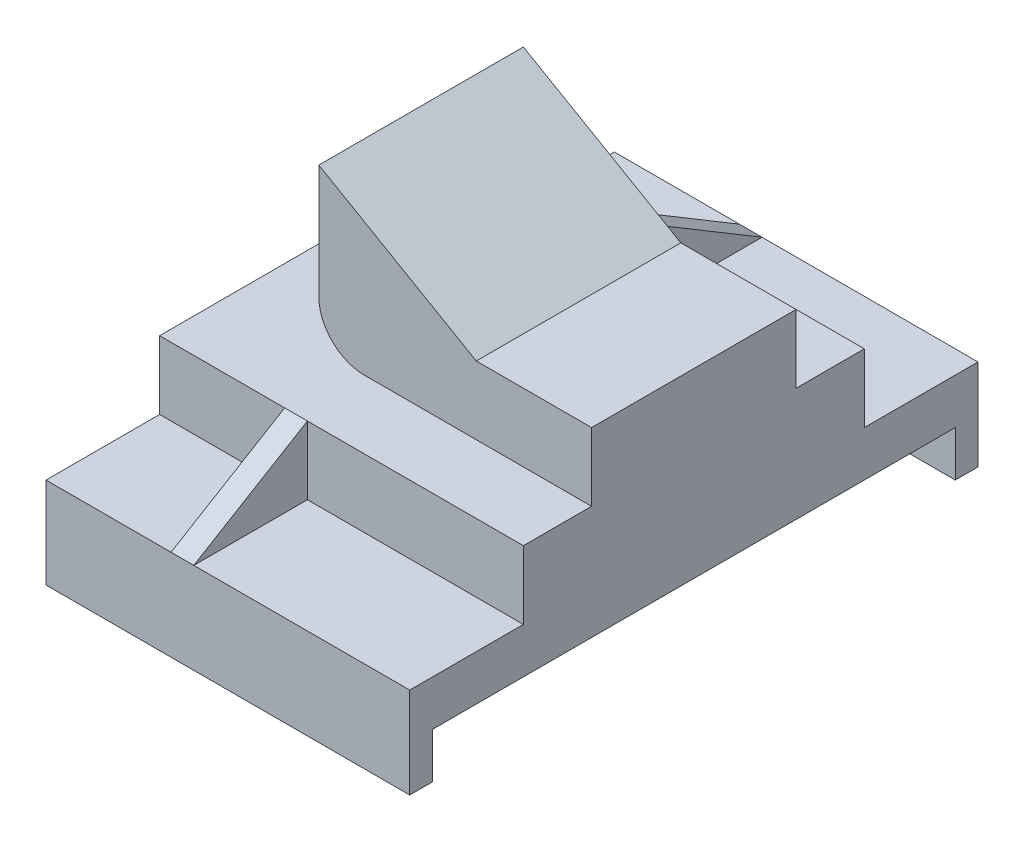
from build123d import *

# Parameters (mm, degrees)
EXTRUDE1_DEPTH      = 40
EXTRUDE2_DEPTH      = 22.5
EXTRUDE2_DEPTH_BACK = 22.5
SKETCH4_W           = 115
SKETCH4_H           = 10
EXTRUDE3_DEPTH      = 2.5


with BuildPart() as part:
    # Sketch1 → Extrude1 (new, symmetric)
    with BuildSketch(Plane(origin=(0, 0, 0), x_dir=(0, 0, -1), z_dir=(1, 0, 0))):
        Polygon((0, 0), (0, 20), (25, 20), (25, 35), (100, 35), (100, 20), (125, 20), (125, 0), (120, 0), (120, 10), (5, 10), (5, 0), align=None)
    extrude(amount=EXTRUDE1_DEPTH, both=True)

    # Sketch2 → Extrude2 (add, two sides: drawn at the far end of the back side and taken through both)
    with BuildSketch(Plane.XY.offset(-62.5).offset(-EXTRUDE2_DEPTH_BACK)):
        with BuildLine():
            Line((-20, 45), (-20, 70))
            Line((-20, 70), (14.641016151, 50))
            Line((14.641016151, 50), (40, 50))
            Line((40, 50), (40, 35))
            Line((40, 35), (-10, 35))
            ThreePointArc((-10, 35), (-17.071067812, 37.928932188), (-20, 45))
        make_face()
    extrude(amount=EXTRUDE2_DEPTH + EXTRUDE2_DEPTH_BACK)

    # Sketch4 → Extrude3 (add, symmetric)
    with BuildSketch(Plane(origin=(-10, 0, 0), x_dir=(0, 0, -1), z_dir=(1, 0, 0))):
        Polygon((0, 20), (25, 35), (25, 20), align=None)
        Polygon((100, 35), (125, 20), (100, 20), align=None)
        with Locations((62.5, 5)):
            Rectangle(SKETCH4_W, SKETCH4_H)
    extrude(amount=EXTRUDE3_DEPTH, both=True)


solid = part.part
